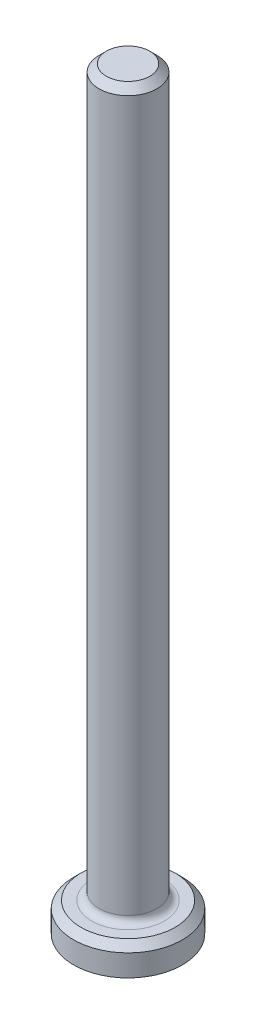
ISO-10303-21;
HEADER;
FILE_DESCRIPTION(('STEP AP214'),'2;1');
FILE_NAME('part.step','',(''),(''),'','','');
FILE_SCHEMA(('AUTOMOTIVE_DESIGN { 1 0 10303 214 1 1 1 1 }'));
ENDSEC;
DATA;
#1=APPLICATION_CONTEXT('core data for automotive mechanical design processes');
#2=APPLICATION_PROTOCOL_DEFINITION('international standard','automotive_design',2000,#1);
#3=PRODUCT_CONTEXT('',#1,'mechanical');
#4=PRODUCT('Part','Part','',(#3));
#5=PRODUCT_RELATED_PRODUCT_CATEGORY('part','',(#4));
#6=PRODUCT_DEFINITION_FORMATION('','',#4);
#7=PRODUCT_DEFINITION_CONTEXT('part definition',#1,'design');
#8=PRODUCT_DEFINITION('design','',#6,#7);
#9=PRODUCT_DEFINITION_SHAPE('','',#8);
#10=(LENGTH_UNIT() NAMED_UNIT(*) SI_UNIT(.MILLI.,.METRE.));
#11=(NAMED_UNIT(*) PLANE_ANGLE_UNIT() SI_UNIT($,.RADIAN.));
#12=(NAMED_UNIT(*) SI_UNIT($,.STERADIAN.) SOLID_ANGLE_UNIT());
#13=UNCERTAINTY_MEASURE_WITH_UNIT(LENGTH_MEASURE(1.E-05),#10,'distance_accuracy_value','');
#14=(GEOMETRIC_REPRESENTATION_CONTEXT(3) GLOBAL_UNCERTAINTY_ASSIGNED_CONTEXT((#13)) GLOBAL_UNIT_ASSIGNED_CONTEXT((#10,
#11,#12)) REPRESENTATION_CONTEXT('',''));
#15=CARTESIAN_POINT('',(0.,0.,0.));
#16=DIRECTION('',(0.,0.,1.));
#17=DIRECTION('',(1.,0.,0.));
#18=AXIS2_PLACEMENT_3D('',#15,#16,#17);
#19=CARTESIAN_POINT('',(0.,1270.,0.));
#20=DIRECTION('',(0.,-1.,0.));
#21=DIRECTION('',(0.,0.,-1.));
#22=AXIS2_PLACEMENT_3D('',#19,#20,#21);
#23=CYLINDRICAL_SURFACE('',#22,101.6);
#24=CARTESIAN_POINT('',(0.,-1244.6,0.));
#25=DIRECTION('',(0.,-1.,0.));
#26=DIRECTION('',(0.,0.,-1.));
#27=AXIS2_PLACEMENT_3D('',#24,#25,#26);
#28=CIRCLE('',#27,101.6);
#29=CARTESIAN_POINT('',(0.,-1244.6,-101.6));
#30=VERTEX_POINT('',#29);
#31=EDGE_CURVE('E45',#30,#30,#28,.F.);
#32=CARTESIAN_POINT('',(0.,1244.6,0.));
#33=DIRECTION('',(0.,1.,0.));
#34=DIRECTION('',(0.,0.,1.));
#35=AXIS2_PLACEMENT_3D('',#32,#33,#34);
#36=CIRCLE('',#35,101.6);
#37=CARTESIAN_POINT('',(0.,1244.6,-101.6));
#38=VERTEX_POINT('',#37);
#39=EDGE_CURVE('E49',#38,#38,#36,.F.);
#40=CARTESIAN_POINT('',(0.,-1244.6,-101.6));
#41=CARTESIAN_POINT('',(0.,-1218.67083333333,-101.6));
#42=CARTESIAN_POINT('',(0.,-1192.74166666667,-101.6));
#43=CARTESIAN_POINT('',(0.,-1140.88333333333,-101.6));
#44=CARTESIAN_POINT('',(0.,-1114.95416666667,-101.6));
#45=CARTESIAN_POINT('',(0.,-1063.09583333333,-101.6));
#46=CARTESIAN_POINT('',(0.,-1037.16666666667,-101.6));
#47=CARTESIAN_POINT('',(0.,-985.308333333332,-101.6));
#48=CARTESIAN_POINT('',(0.,-959.379166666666,-101.6));
#49=CARTESIAN_POINT('',(0.,-907.520833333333,-101.6));
#50=CARTESIAN_POINT('',(0.,-881.591666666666,-101.6));
#51=CARTESIAN_POINT('',(0.,-829.733333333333,-101.6));
#52=CARTESIAN_POINT('',(0.,-803.804166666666,-101.6));
#53=CARTESIAN_POINT('',(0.,-751.945833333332,-101.6));
#54=CARTESIAN_POINT('',(0.,-726.016666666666,-101.6));
#55=CARTESIAN_POINT('',(0.,-674.158333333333,-101.6));
#56=CARTESIAN_POINT('',(0.,-648.229166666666,-101.6));
#57=CARTESIAN_POINT('',(0.,-596.370833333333,-101.6));
#58=CARTESIAN_POINT('',(0.,-570.441666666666,-101.6));
#59=CARTESIAN_POINT('',(0.,-518.583333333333,-101.6));
#60=CARTESIAN_POINT('',(0.,-492.654166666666,-101.6));
#61=CARTESIAN_POINT('',(0.,-440.795833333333,-101.6));
#62=CARTESIAN_POINT('',(0.,-414.866666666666,-101.6));
#63=CARTESIAN_POINT('',(0.,-363.008333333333,-101.6));
#64=CARTESIAN_POINT('',(0.,-337.079166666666,-101.6));
#65=CARTESIAN_POINT('',(0.,-285.220833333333,-101.6));
#66=CARTESIAN_POINT('',(0.,-259.291666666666,-101.6));
#67=CARTESIAN_POINT('',(0.,-207.433333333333,-101.6));
#68=CARTESIAN_POINT('',(0.,-181.504166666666,-101.6));
#69=CARTESIAN_POINT('',(0.,-129.645833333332,-101.6));
#70=CARTESIAN_POINT('',(0.,-103.716666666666,-101.6));
#71=CARTESIAN_POINT('',(0.,-51.8583333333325,-101.6));
#72=CARTESIAN_POINT('',(0.,-25.9291666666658,-101.6));
#73=CARTESIAN_POINT('',(0.,25.9291666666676,-101.6));
#74=CARTESIAN_POINT('',(0.,51.8583333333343,-101.6));
#75=CARTESIAN_POINT('',(0.,103.716666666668,-101.6));
#76=CARTESIAN_POINT('',(0.,129.645833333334,-101.6));
#77=CARTESIAN_POINT('',(0.,181.504166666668,-101.6));
#78=CARTESIAN_POINT('',(0.,207.433333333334,-101.6));
#79=CARTESIAN_POINT('',(0.,259.291666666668,-101.6));
#80=CARTESIAN_POINT('',(0.,285.220833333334,-101.6));
#81=CARTESIAN_POINT('',(0.,337.079166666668,-101.6));
#82=CARTESIAN_POINT('',(0.,363.008333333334,-101.6));
#83=CARTESIAN_POINT('',(0.,414.866666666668,-101.6));
#84=CARTESIAN_POINT('',(0.,440.795833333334,-101.6));
#85=CARTESIAN_POINT('',(0.,492.654166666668,-101.6));
#86=CARTESIAN_POINT('',(0.,518.583333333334,-101.6));
#87=CARTESIAN_POINT('',(0.,570.441666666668,-101.6));
#88=CARTESIAN_POINT('',(0.,596.370833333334,-101.6));
#89=CARTESIAN_POINT('',(0.,648.229166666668,-101.6));
#90=CARTESIAN_POINT('',(0.,674.158333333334,-101.6));
#91=CARTESIAN_POINT('',(0.,726.016666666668,-101.6));
#92=CARTESIAN_POINT('',(0.,751.945833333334,-101.6));
#93=CARTESIAN_POINT('',(0.,803.804166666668,-101.6));
#94=CARTESIAN_POINT('',(0.,829.733333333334,-101.6));
#95=CARTESIAN_POINT('',(0.,881.591666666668,-101.6));
#96=CARTESIAN_POINT('',(0.,907.520833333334,-101.6));
#97=CARTESIAN_POINT('',(0.,959.379166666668,-101.6));
#98=CARTESIAN_POINT('',(0.,985.308333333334,-101.6));
#99=CARTESIAN_POINT('',(0.,1037.16666666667,-101.6));
#100=CARTESIAN_POINT('',(0.,1063.09583333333,-101.6));
#101=CARTESIAN_POINT('',(0.,1114.95416666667,-101.6));
#102=CARTESIAN_POINT('',(0.,1140.88333333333,-101.6));
#103=CARTESIAN_POINT('',(0.,1192.74166666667,-101.6));
#104=CARTESIAN_POINT('',(0.,1218.67083333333,-101.6));
#105=CARTESIAN_POINT('',(0.,1244.6,-101.6));
#106=B_SPLINE_CURVE_WITH_KNOTS('',3,(#40,#41,#42,#43,#44,#45,#46,#47,#48,#49,#50,#51,#52,#53,
#54,#55,#56,#57,#58,#59,#60,#61,#62,#63,#64,#65,#66,#67,#68,#69,#70,#71,#72,#73,#74,#75,#76,#77,
#78,#79,#80,#81,#82,#83,#84,#85,#86,#87,#88,#89,#90,#91,#92,#93,#94,#95,#96,#97,#98,#99,#100,
#101,#102,#103,#104,#105),.UNSPECIFIED.,.F.,.F.,(4,2,2,2,2,2,2,2,2,2,2,2,2,2,2,2,2,2,2,2,2,2,2,
2,2,2,2,2,2,2,2,2,4),(0.,77.7874999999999,155.575,233.3625,311.15,388.9375,466.725,544.5125,
622.3,700.0875,777.875,855.6625,933.45,1011.2375,1089.025,1166.8125,1244.6,1322.3875,1400.175,
1477.9625,1555.75,1633.5375,1711.325,1789.1125,1866.9,1944.6875,2022.475,2100.2625,2178.05,
2255.8375,2333.625,2411.4125,2489.2),.UNSPECIFIED.);
#107=EDGE_CURVE('BSEAM38',#30,#38,#106,.T.);
#108=ORIENTED_EDGE('',*,*,#31,.T.);
#109=ORIENTED_EDGE('',*,*,#39,.T.);
#110=ORIENTED_EDGE('',*,*,#107,.T.);
#111=ORIENTED_EDGE('',*,*,#107,.F.);
#112=EDGE_LOOP('',(#108,#110,#109,#111));
#113=FACE_BOUND('',#112,.T.);
#114=ADVANCED_FACE('F38',(#113),#23,.T.);
#115=CARTESIAN_POINT('',(0.,1270.,0.));
#116=DIRECTION('',(0.,1.,0.));
#117=DIRECTION('',(0.,0.,1.));
#118=AXIS2_PLACEMENT_3D('',#115,#116,#117);
#119=PLANE('',#118);
#120=CARTESIAN_POINT('',(0.,1270.,0.));
#121=DIRECTION('',(0.,1.,0.));
#122=DIRECTION('',(0.,0.,1.));
#123=AXIS2_PLACEMENT_3D('',#120,#121,#122);
#124=CIRCLE('',#123,76.2000000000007);
#125=CARTESIAN_POINT('',(0.,1270.,76.2000000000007));
#126=VERTEX_POINT('',#125);
#127=EDGE_CURVE('E53',#126,#126,#124,.T.);
#128=ORIENTED_EDGE('',*,*,#127,.T.);
#129=EDGE_LOOP('',(#128));
#130=FACE_BOUND('',#129,.T.);
#131=ADVANCED_FACE('F72',(#130),#119,.T.);
#132=CARTESIAN_POINT('',(0.,-1371.6,0.));
#133=DIRECTION('',(0.,1.,0.));
#134=DIRECTION('',(0.,0.,1.));
#135=AXIS2_PLACEMENT_3D('',#132,#133,#134);
#136=CYLINDRICAL_SURFACE('',#135,190.5);
#137=CARTESIAN_POINT('',(0.,-1295.4,0.));
#138=DIRECTION('',(0.,-1.,0.));
#139=DIRECTION('',(0.,0.,-1.));
#140=AXIS2_PLACEMENT_3D('',#137,#138,#139);
#141=CIRCLE('',#140,190.5);
#142=CARTESIAN_POINT('',(0.,-1295.4,-190.5));
#143=VERTEX_POINT('',#142);
#144=EDGE_CURVE('E61',#143,#143,#141,.T.);
#145=ORIENTED_EDGE('',*,*,#144,.T.);
#146=EDGE_LOOP('',(#145));
#147=FACE_BOUND('',#146,.T.);
#148=CARTESIAN_POINT('',(0.,-1371.6,0.));
#149=DIRECTION('',(0.,-1.,0.));
#150=DIRECTION('',(0.,0.,-1.));
#151=AXIS2_PLACEMENT_3D('',#148,#149,#150);
#152=CIRCLE('',#151,190.5);
#153=CARTESIAN_POINT('',(0.,-1371.6,-190.5));
#154=VERTEX_POINT('',#153);
#155=EDGE_CURVE('E64',#154,#154,#152,.T.);
#156=ORIENTED_EDGE('',*,*,#155,.F.);
#157=EDGE_LOOP('',(#156));
#158=FACE_BOUND('',#157,.T.);
#159=ADVANCED_FACE('F70',(#147,#158),#136,.T.);
#160=CARTESIAN_POINT('',(0.,-1371.6,0.));
#161=DIRECTION('',(0.,-1.,0.));
#162=DIRECTION('',(0.,0.,-1.));
#163=AXIS2_PLACEMENT_3D('',#160,#161,#162);
#164=PLANE('',#163);
#165=ORIENTED_EDGE('',*,*,#155,.T.);
#166=EDGE_LOOP('',(#165));
#167=FACE_BOUND('',#166,.T.);
#168=ADVANCED_FACE('F68',(#167),#164,.T.);
#169=CARTESIAN_POINT('',(0.,-1270.,0.));
#170=DIRECTION('',(0.,-1.,0.));
#171=DIRECTION('',(0.,0.,-1.));
#172=AXIS2_PLACEMENT_3D('',#169,#170,#171);
#173=PLANE('',#172);
#174=CARTESIAN_POINT('',(0.,-1270.,0.));
#175=DIRECTION('',(0.,-1.,0.));
#176=DIRECTION('',(0.,0.,-1.));
#177=AXIS2_PLACEMENT_3D('',#174,#175,#176);
#178=CIRCLE('',#177,127.);
#179=CARTESIAN_POINT('',(0.,-1270.,-127.));
#180=VERTEX_POINT('',#179);
#181=EDGE_CURVE('E10',#180,#180,#178,.T.);
#182=ORIENTED_EDGE('',*,*,#181,.T.);
#183=EDGE_LOOP('',(#182));
#184=FACE_BOUND('',#183,.T.);
#185=CARTESIAN_POINT('',(0.,-1270.,0.));
#186=DIRECTION('',(0.,-1.,0.));
#187=DIRECTION('',(0.,0.,-1.));
#188=AXIS2_PLACEMENT_3D('',#185,#186,#187);
#189=CIRCLE('',#188,165.1);
#190=CARTESIAN_POINT('',(0.,-1270.,-165.1));
#191=VERTEX_POINT('',#190);
#192=EDGE_CURVE('E58',#191,#191,#189,.F.);
#193=ORIENTED_EDGE('',*,*,#192,.T.);
#194=EDGE_LOOP('',(#193));
#195=FACE_BOUND('',#194,.T.);
#196=ADVANCED_FACE('F79',(#184,#195),#173,.F.);
#197=CARTESIAN_POINT('',(0.,-1295.4,0.));
#198=DIRECTION('',(0.,-1.,0.));
#199=DIRECTION('',(0.,0.,-1.));
#200=AXIS2_PLACEMENT_3D('',#197,#198,#199);
#201=CONICAL_SURFACE('',#200,190.5,0.785398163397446);
#202=ORIENTED_EDGE('',*,*,#192,.F.);
#203=EDGE_LOOP('',(#202));
#204=FACE_BOUND('',#203,.T.);
#205=ORIENTED_EDGE('',*,*,#144,.F.);
#206=EDGE_LOOP('',(#205));
#207=FACE_BOUND('',#206,.T.);
#208=ADVANCED_FACE('F91',(#204,#207),#201,.T.);
#209=CARTESIAN_POINT('',(0.,1270.,0.));
#210=DIRECTION('',(0.,-1.,0.));
#211=DIRECTION('',(0.,0.,-1.));
#212=AXIS2_PLACEMENT_3D('',#209,#210,#211);
#213=CONICAL_SURFACE('',#212,76.2000000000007,0.785398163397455);
#214=ORIENTED_EDGE('',*,*,#39,.F.);
#215=EDGE_LOOP('',(#214));
#216=FACE_BOUND('',#215,.T.);
#217=ORIENTED_EDGE('',*,*,#127,.F.);
#218=EDGE_LOOP('',(#217));
#219=FACE_BOUND('',#218,.T.);
#220=ADVANCED_FACE('F96',(#216,#219),#213,.T.);
#221=CARTESIAN_POINT('',(0.,-1244.6,0.));
#222=DIRECTION('',(0.,-1.,0.));
#223=DIRECTION('',(0.,0.,-1.));
#224=AXIS2_PLACEMENT_3D('',#221,#222,#223);
#225=TOROIDAL_SURFACE('',#224,127.,25.4);
#226=ORIENTED_EDGE('',*,*,#181,.F.);
#227=EDGE_LOOP('',(#226));
#228=FACE_BOUND('',#227,.T.);
#229=ORIENTED_EDGE('',*,*,#31,.F.);
#230=EDGE_LOOP('',(#229));
#231=FACE_BOUND('',#230,.T.);
#232=ADVANCED_FACE('F40',(#228,#231),#225,.F.);
#233=CLOSED_SHELL('',(#114,#131,#159,#168,#196,#208,#220,#232));
#234=MANIFOLD_SOLID_BREP('B2',#233);
#235=ADVANCED_BREP_SHAPE_REPRESENTATION('',(#18,#234),#14);
#236=SHAPE_DEFINITION_REPRESENTATION(#9,#235);
ENDSEC;
END-ISO-10303-21;
